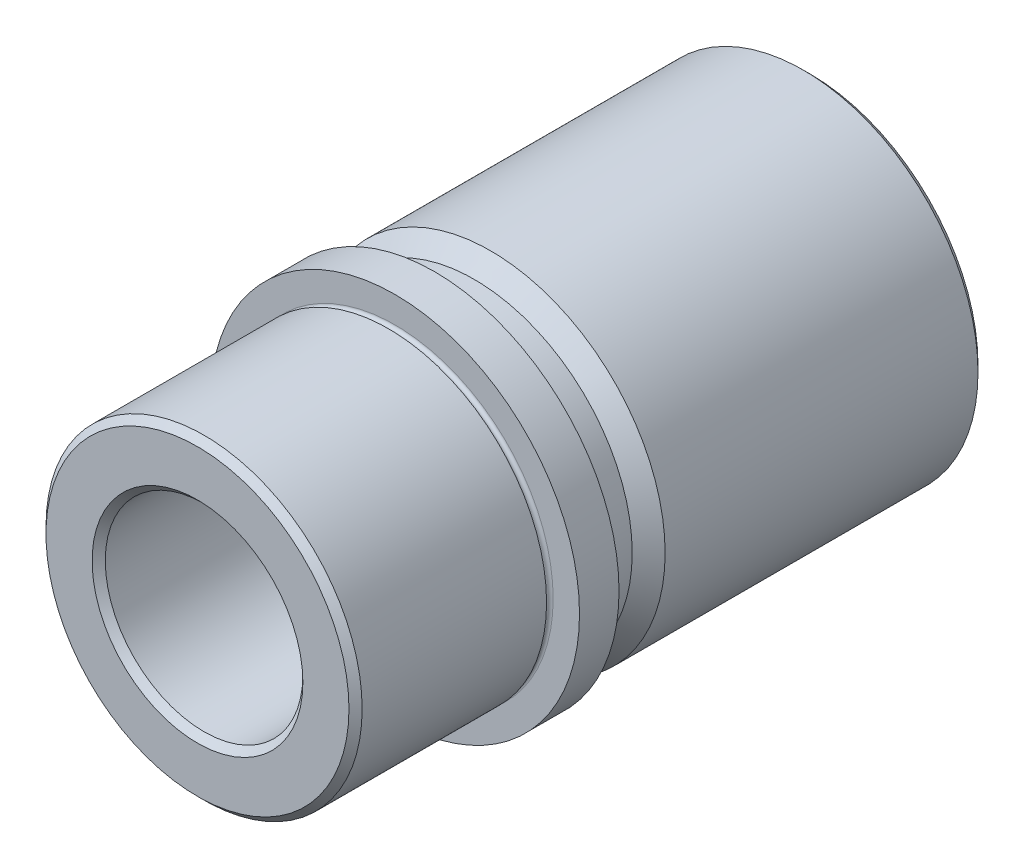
ISO-10303-21;
HEADER;
FILE_DESCRIPTION(('STEP AP214'),'2;1');
FILE_NAME('part.step','',(''),(''),'','','');
FILE_SCHEMA(('AUTOMOTIVE_DESIGN { 1 0 10303 214 1 1 1 1 }'));
ENDSEC;
DATA;
#1=APPLICATION_CONTEXT('core data for automotive mechanical design processes');
#2=APPLICATION_PROTOCOL_DEFINITION('international standard','automotive_design',2000,#1);
#3=PRODUCT_CONTEXT('',#1,'mechanical');
#4=PRODUCT('Part','Part','',(#3));
#5=PRODUCT_RELATED_PRODUCT_CATEGORY('part','',(#4));
#6=PRODUCT_DEFINITION_FORMATION('','',#4);
#7=PRODUCT_DEFINITION_CONTEXT('part definition',#1,'design');
#8=PRODUCT_DEFINITION('design','',#6,#7);
#9=PRODUCT_DEFINITION_SHAPE('','',#8);
#10=(LENGTH_UNIT() NAMED_UNIT(*) SI_UNIT(.MILLI.,.METRE.));
#11=(NAMED_UNIT(*) PLANE_ANGLE_UNIT() SI_UNIT($,.RADIAN.));
#12=(NAMED_UNIT(*) SI_UNIT($,.STERADIAN.) SOLID_ANGLE_UNIT());
#13=UNCERTAINTY_MEASURE_WITH_UNIT(LENGTH_MEASURE(1.E-05),#10,'distance_accuracy_value','');
#14=(GEOMETRIC_REPRESENTATION_CONTEXT(3) GLOBAL_UNCERTAINTY_ASSIGNED_CONTEXT((#13)) GLOBAL_UNIT_ASSIGNED_CONTEXT((#10,
#11,#12)) REPRESENTATION_CONTEXT('',''));
#15=CARTESIAN_POINT('',(0.,0.,0.));
#16=DIRECTION('',(0.,0.,1.));
#17=DIRECTION('',(1.,0.,0.));
#18=AXIS2_PLACEMENT_3D('',#15,#16,#17);
#19=CARTESIAN_POINT('',(0.,0.,-55.5));
#20=DIRECTION('',(0.,0.,1.));
#21=DIRECTION('',(1.,0.,0.));
#22=AXIS2_PLACEMENT_3D('',#19,#20,#21);
#23=TOROIDAL_SURFACE('',#22,15.5,0.5);
#24=CARTESIAN_POINT('',(0.,0.,-55.5));
#25=DIRECTION('',(0.,0.,1.));
#26=DIRECTION('',(1.,0.,0.));
#27=AXIS2_PLACEMENT_3D('',#24,#25,#26);
#28=CIRCLE('',#27,15.);
#29=CARTESIAN_POINT('',(15.,0.,-55.5));
#30=VERTEX_POINT('',#29);
#31=EDGE_CURVE('E82',#30,#30,#28,.T.);
#32=ORIENTED_EDGE('',*,*,#31,.T.);
#33=EDGE_LOOP('',(#32));
#34=FACE_BOUND('',#33,.T.);
#35=CARTESIAN_POINT('',(0.,0.,-56.));
#36=DIRECTION('',(0.,0.,1.));
#37=DIRECTION('',(1.,0.,0.));
#38=AXIS2_PLACEMENT_3D('',#35,#36,#37);
#39=CIRCLE('',#38,15.5);
#40=CARTESIAN_POINT('',(15.5,0.,-56.));
#41=VERTEX_POINT('',#40);
#42=EDGE_CURVE('E46',#41,#41,#39,.T.);
#43=ORIENTED_EDGE('',*,*,#42,.F.);
#44=EDGE_LOOP('',(#43));
#45=FACE_BOUND('',#44,.T.);
#46=ADVANCED_FACE('F14',(#34,#45),#23,.T.);
#47=CARTESIAN_POINT('',(0.,0.,-56.5));
#48=DIRECTION('',(0.,0.,1.));
#49=DIRECTION('',(1.,0.,0.));
#50=AXIS2_PLACEMENT_3D('',#47,#48,#49);
#51=TOROIDAL_SURFACE('',#50,15.5,0.5);
#52=CARTESIAN_POINT('',(0.,0.,-56.5));
#53=DIRECTION('',(0.,0.,1.));
#54=DIRECTION('',(1.,0.,0.));
#55=AXIS2_PLACEMENT_3D('',#52,#53,#54);
#56=CIRCLE('',#55,15.);
#57=CARTESIAN_POINT('',(15.,0.,-56.5));
#58=VERTEX_POINT('',#57);
#59=EDGE_CURVE('E49',#58,#58,#56,.T.);
#60=ORIENTED_EDGE('',*,*,#59,.F.);
#61=EDGE_LOOP('',(#60));
#62=FACE_BOUND('',#61,.T.);
#63=ORIENTED_EDGE('',*,*,#42,.T.);
#64=EDGE_LOOP('',(#63));
#65=FACE_BOUND('',#64,.T.);
#66=ADVANCED_FACE('F114',(#62,#65),#51,.T.);
#67=CARTESIAN_POINT('',(0.,0.,0.));
#68=DIRECTION('',(0.,0.,1.));
#69=DIRECTION('',(1.,0.,0.));
#70=AXIS2_PLACEMENT_3D('',#67,#68,#69);
#71=CYLINDRICAL_SURFACE('',#70,15.);
#72=CARTESIAN_POINT('',(0.,0.,-92.));
#73=DIRECTION('',(0.,0.,1.));
#74=DIRECTION('',(1.,0.,0.));
#75=AXIS2_PLACEMENT_3D('',#72,#73,#74);
#76=CIRCLE('',#75,15.);
#77=CARTESIAN_POINT('',(15.,0.,-92.));
#78=VERTEX_POINT('',#77);
#79=EDGE_CURVE('E37',#78,#78,#76,.F.);
#80=ORIENTED_EDGE('',*,*,#79,.T.);
#81=EDGE_LOOP('',(#80));
#82=FACE_BOUND('',#81,.T.);
#83=ORIENTED_EDGE('',*,*,#59,.T.);
#84=EDGE_LOOP('',(#83));
#85=FACE_BOUND('',#84,.T.);
#86=ADVANCED_FACE('F119',(#82,#85),#71,.F.);
#87=CARTESIAN_POINT('',(0.,0.,-93.));
#88=DIRECTION('',(0.,0.,1.));
#89=DIRECTION('',(1.,0.,0.));
#90=AXIS2_PLACEMENT_3D('',#87,#88,#89);
#91=PLANE('',#90);
#92=CARTESIAN_POINT('',(0.,0.,-93.));
#93=DIRECTION('',(0.,0.,1.));
#94=DIRECTION('',(1.,0.,0.));
#95=AXIS2_PLACEMENT_3D('',#92,#93,#94);
#96=CIRCLE('',#95,16.);
#97=CARTESIAN_POINT('',(16.,0.,-93.));
#98=VERTEX_POINT('',#97);
#99=EDGE_CURVE('E40',#98,#98,#96,.T.);
#100=ORIENTED_EDGE('',*,*,#99,.T.);
#101=EDGE_LOOP('',(#100));
#102=FACE_BOUND('',#101,.T.);
#103=CARTESIAN_POINT('',(0.,0.,-93.));
#104=DIRECTION('',(0.,0.,1.));
#105=DIRECTION('',(1.,0.,0.));
#106=AXIS2_PLACEMENT_3D('',#103,#104,#105);
#107=CIRCLE('',#106,25.5);
#108=CARTESIAN_POINT('',(25.5,0.,-93.));
#109=VERTEX_POINT('',#108);
#110=EDGE_CURVE('E43',#109,#109,#107,.F.);
#111=ORIENTED_EDGE('',*,*,#110,.T.);
#112=EDGE_LOOP('',(#111));
#113=FACE_BOUND('',#112,.T.);
#114=ADVANCED_FACE('F186',(#102,#113),#91,.F.);
#115=CARTESIAN_POINT('',(0.,0.,0.));
#116=DIRECTION('',(0.,0.,1.));
#117=DIRECTION('',(1.,0.,0.));
#118=AXIS2_PLACEMENT_3D('',#115,#116,#117);
#119=CYLINDRICAL_SURFACE('',#118,26.5);
#120=CARTESIAN_POINT('',(0.,0.,-92.));
#121=DIRECTION('',(0.,0.,1.));
#122=DIRECTION('',(1.,0.,0.));
#123=AXIS2_PLACEMENT_3D('',#120,#121,#122);
#124=CIRCLE('',#123,26.5);
#125=CARTESIAN_POINT('',(26.5,0.,-92.));
#126=VERTEX_POINT('',#125);
#127=EDGE_CURVE('E34',#126,#126,#124,.T.);
#128=ORIENTED_EDGE('',*,*,#127,.T.);
#129=EDGE_LOOP('',(#128));
#130=FACE_BOUND('',#129,.T.);
#131=CARTESIAN_POINT('',(0.,0.,-44.5));
#132=DIRECTION('',(0.,0.,1.));
#133=DIRECTION('',(1.,0.,0.));
#134=AXIS2_PLACEMENT_3D('',#131,#132,#133);
#135=CIRCLE('',#134,26.5);
#136=CARTESIAN_POINT('',(26.5,0.,-44.5));
#137=VERTEX_POINT('',#136);
#138=EDGE_CURVE('E52',#137,#137,#135,.T.);
#139=ORIENTED_EDGE('',*,*,#138,.F.);
#140=EDGE_LOOP('',(#139));
#141=FACE_BOUND('',#140,.T.);
#142=ADVANCED_FACE('F182',(#130,#141),#119,.T.);
#143=CARTESIAN_POINT('',(0.,0.,-42.));
#144=DIRECTION('',(0.,0.,-1.));
#145=DIRECTION('',(-1.,0.,0.));
#146=AXIS2_PLACEMENT_3D('',#143,#144,#145);
#147=CONICAL_SURFACE('',#146,24.,0.78539816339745);
#148=ORIENTED_EDGE('',*,*,#138,.T.);
#149=EDGE_LOOP('',(#148));
#150=FACE_BOUND('',#149,.T.);
#151=CARTESIAN_POINT('',(0.,0.,-42.));
#152=DIRECTION('',(0.,0.,1.));
#153=DIRECTION('',(1.,0.,0.));
#154=AXIS2_PLACEMENT_3D('',#151,#152,#153);
#155=CIRCLE('',#154,24.);
#156=CARTESIAN_POINT('',(24.,0.,-42.));
#157=VERTEX_POINT('',#156);
#158=EDGE_CURVE('E55',#157,#157,#155,.T.);
#159=ORIENTED_EDGE('',*,*,#158,.F.);
#160=EDGE_LOOP('',(#159));
#161=FACE_BOUND('',#160,.T.);
#162=ADVANCED_FACE('F178',(#150,#161),#147,.T.);
#163=CARTESIAN_POINT('',(0.,0.,0.));
#164=DIRECTION('',(0.,0.,1.));
#165=DIRECTION('',(1.,0.,0.));
#166=AXIS2_PLACEMENT_3D('',#163,#164,#165);
#167=CYLINDRICAL_SURFACE('',#166,24.);
#168=ORIENTED_EDGE('',*,*,#158,.T.);
#169=EDGE_LOOP('',(#168));
#170=FACE_BOUND('',#169,.T.);
#171=CARTESIAN_POINT('',(0.,0.,-36.));
#172=DIRECTION('',(0.,0.,1.));
#173=DIRECTION('',(1.,0.,0.));
#174=AXIS2_PLACEMENT_3D('',#171,#172,#173);
#175=CIRCLE('',#174,24.);
#176=CARTESIAN_POINT('',(24.,0.,-36.));
#177=VERTEX_POINT('',#176);
#178=EDGE_CURVE('E58',#177,#177,#175,.T.);
#179=ORIENTED_EDGE('',*,*,#178,.F.);
#180=EDGE_LOOP('',(#179));
#181=FACE_BOUND('',#180,.T.);
#182=ADVANCED_FACE('F174',(#170,#181),#167,.T.);
#183=CARTESIAN_POINT('',(0.,0.,-36.));
#184=DIRECTION('',(0.,0.,-1.));
#185=DIRECTION('',(-1.,0.,0.));
#186=AXIS2_PLACEMENT_3D('',#183,#184,#185);
#187=PLANE('',#186);
#188=ORIENTED_EDGE('',*,*,#178,.T.);
#189=EDGE_LOOP('',(#188));
#190=FACE_BOUND('',#189,.T.);
#191=CARTESIAN_POINT('',(0.,0.,-36.));
#192=DIRECTION('',(0.,0.,1.));
#193=DIRECTION('',(1.,0.,0.));
#194=AXIS2_PLACEMENT_3D('',#191,#192,#193);
#195=CIRCLE('',#194,28.);
#196=CARTESIAN_POINT('',(28.,0.,-36.));
#197=VERTEX_POINT('',#196);
#198=EDGE_CURVE('E61',#197,#197,#195,.T.);
#199=ORIENTED_EDGE('',*,*,#198,.F.);
#200=EDGE_LOOP('',(#199));
#201=FACE_BOUND('',#200,.T.);
#202=ADVANCED_FACE('F170',(#190,#201),#187,.T.);
#203=CARTESIAN_POINT('',(0.,0.,0.));
#204=DIRECTION('',(0.,0.,1.));
#205=DIRECTION('',(1.,0.,0.));
#206=AXIS2_PLACEMENT_3D('',#203,#204,#205);
#207=CYLINDRICAL_SURFACE('',#206,28.);
#208=ORIENTED_EDGE('',*,*,#198,.T.);
#209=EDGE_LOOP('',(#208));
#210=FACE_BOUND('',#209,.T.);
#211=CARTESIAN_POINT('',(0.,0.,-30.));
#212=DIRECTION('',(0.,0.,1.));
#213=DIRECTION('',(1.,0.,0.));
#214=AXIS2_PLACEMENT_3D('',#211,#212,#213);
#215=CIRCLE('',#214,28.);
#216=CARTESIAN_POINT('',(28.,0.,-30.));
#217=VERTEX_POINT('',#216);
#218=EDGE_CURVE('E64',#217,#217,#215,.T.);
#219=ORIENTED_EDGE('',*,*,#218,.F.);
#220=EDGE_LOOP('',(#219));
#221=FACE_BOUND('',#220,.T.);
#222=ADVANCED_FACE('F166',(#210,#221),#207,.T.);
#223=CARTESIAN_POINT('',(0.,0.,-30.));
#224=DIRECTION('',(0.,0.,1.));
#225=DIRECTION('',(1.,0.,0.));
#226=AXIS2_PLACEMENT_3D('',#223,#224,#225);
#227=PLANE('',#226);
#228=ORIENTED_EDGE('',*,*,#218,.T.);
#229=EDGE_LOOP('',(#228));
#230=FACE_BOUND('',#229,.T.);
#231=CARTESIAN_POINT('',(0.,0.,-30.));
#232=DIRECTION('',(0.,0.,1.));
#233=DIRECTION('',(1.,0.,0.));
#234=AXIS2_PLACEMENT_3D('',#231,#232,#233);
#235=CIRCLE('',#234,24.);
#236=CARTESIAN_POINT('',(24.,0.,-30.));
#237=VERTEX_POINT('',#236);
#238=EDGE_CURVE('E67',#237,#237,#235,.T.);
#239=ORIENTED_EDGE('',*,*,#238,.F.);
#240=EDGE_LOOP('',(#239));
#241=FACE_BOUND('',#240,.T.);
#242=ADVANCED_FACE('F162',(#230,#241),#227,.T.);
#243=CARTESIAN_POINT('',(0.,0.,-29.5));
#244=DIRECTION('',(0.,0.,1.));
#245=DIRECTION('',(1.,0.,0.));
#246=AXIS2_PLACEMENT_3D('',#243,#244,#245);
#247=TOROIDAL_SURFACE('',#246,24.,0.5);
#248=ORIENTED_EDGE('',*,*,#238,.T.);
#249=EDGE_LOOP('',(#248));
#250=FACE_BOUND('',#249,.T.);
#251=CARTESIAN_POINT('',(0.,0.,-29.));
#252=DIRECTION('',(0.,0.,1.));
#253=DIRECTION('',(1.,0.,0.));
#254=AXIS2_PLACEMENT_3D('',#251,#252,#253);
#255=CIRCLE('',#254,24.);
#256=CARTESIAN_POINT('',(24.,0.,-29.));
#257=VERTEX_POINT('',#256);
#258=EDGE_CURVE('E70',#257,#257,#255,.T.);
#259=ORIENTED_EDGE('',*,*,#258,.F.);
#260=EDGE_LOOP('',(#259));
#261=FACE_BOUND('',#260,.T.);
#262=ADVANCED_FACE('F157',(#250,#261),#247,.F.);
#263=CARTESIAN_POINT('',(0.,0.,0.));
#264=DIRECTION('',(0.,0.,1.));
#265=DIRECTION('',(1.,0.,0.));
#266=AXIS2_PLACEMENT_3D('',#263,#264,#265);
#267=CYLINDRICAL_SURFACE('',#266,24.);
#268=CARTESIAN_POINT('',(0.,0.,-1.00000000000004));
#269=DIRECTION('',(0.,0.,1.));
#270=DIRECTION('',(1.,0.,0.));
#271=AXIS2_PLACEMENT_3D('',#268,#269,#270);
#272=CIRCLE('',#271,24.);
#273=CARTESIAN_POINT('',(24.,0.,-1.00000000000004));
#274=VERTEX_POINT('',#273);
#275=EDGE_CURVE('E9',#274,#274,#272,.F.);
#276=ORIENTED_EDGE('',*,*,#275,.T.);
#277=EDGE_LOOP('',(#276));
#278=FACE_BOUND('',#277,.T.);
#279=ORIENTED_EDGE('',*,*,#258,.T.);
#280=EDGE_LOOP('',(#279));
#281=FACE_BOUND('',#280,.T.);
#282=ADVANCED_FACE('F150',(#278,#281),#267,.T.);
#283=CARTESIAN_POINT('',(0.,0.,0.));
#284=DIRECTION('',(0.,0.,1.));
#285=DIRECTION('',(1.,0.,0.));
#286=AXIS2_PLACEMENT_3D('',#283,#284,#285);
#287=PLANE('',#286);
#288=CARTESIAN_POINT('',(0.,0.,0.));
#289=DIRECTION('',(0.,0.,1.));
#290=DIRECTION('',(1.,0.,0.));
#291=AXIS2_PLACEMENT_3D('',#288,#289,#290);
#292=CIRCLE('',#291,16.);
#293=CARTESIAN_POINT('',(16.,0.,0.));
#294=VERTEX_POINT('',#293);
#295=EDGE_CURVE('E21',#294,#294,#292,.F.);
#296=ORIENTED_EDGE('',*,*,#295,.T.);
#297=EDGE_LOOP('',(#296));
#298=FACE_BOUND('',#297,.T.);
#299=CARTESIAN_POINT('',(0.,0.,0.));
#300=DIRECTION('',(0.,0.,1.));
#301=DIRECTION('',(1.,0.,0.));
#302=AXIS2_PLACEMENT_3D('',#299,#300,#301);
#303=CIRCLE('',#302,23.);
#304=CARTESIAN_POINT('',(23.,0.,0.));
#305=VERTEX_POINT('',#304);
#306=EDGE_CURVE('E25',#305,#305,#303,.T.);
#307=ORIENTED_EDGE('',*,*,#306,.T.);
#308=EDGE_LOOP('',(#307));
#309=FACE_BOUND('',#308,.T.);
#310=ADVANCED_FACE('F110',(#298,#309),#287,.T.);
#311=CARTESIAN_POINT('',(0.,0.,0.));
#312=DIRECTION('',(0.,0.,1.));
#313=DIRECTION('',(1.,0.,0.));
#314=AXIS2_PLACEMENT_3D('',#311,#312,#313);
#315=CYLINDRICAL_SURFACE('',#314,15.);
#316=CARTESIAN_POINT('',(0.,0.,-0.999999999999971));
#317=DIRECTION('',(0.,0.,1.));
#318=DIRECTION('',(1.,0.,0.));
#319=AXIS2_PLACEMENT_3D('',#316,#317,#318);
#320=CIRCLE('',#319,15.);
#321=CARTESIAN_POINT('',(15.,0.,-0.999999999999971));
#322=VERTEX_POINT('',#321);
#323=EDGE_CURVE('E29',#322,#322,#320,.T.);
#324=ORIENTED_EDGE('',*,*,#323,.T.);
#325=EDGE_LOOP('',(#324));
#326=FACE_BOUND('',#325,.T.);
#327=CARTESIAN_POINT('',(0.,0.,-22.5));
#328=DIRECTION('',(0.,0.,1.));
#329=DIRECTION('',(1.,0.,0.));
#330=AXIS2_PLACEMENT_3D('',#327,#328,#329);
#331=CIRCLE('',#330,15.);
#332=CARTESIAN_POINT('',(15.,0.,-22.5));
#333=VERTEX_POINT('',#332);
#334=EDGE_CURVE('E73',#333,#333,#331,.T.);
#335=ORIENTED_EDGE('',*,*,#334,.F.);
#336=EDGE_LOOP('',(#335));
#337=FACE_BOUND('',#336,.T.);
#338=ADVANCED_FACE('F103',(#326,#337),#315,.F.);
#339=CARTESIAN_POINT('',(0.,0.,-22.5));
#340=DIRECTION('',(0.,0.,1.));
#341=DIRECTION('',(1.,0.,0.));
#342=AXIS2_PLACEMENT_3D('',#339,#340,#341);
#343=TOROIDAL_SURFACE('',#342,15.5,0.5);
#344=ORIENTED_EDGE('',*,*,#334,.T.);
#345=EDGE_LOOP('',(#344));
#346=FACE_BOUND('',#345,.T.);
#347=CARTESIAN_POINT('',(0.,0.,-23.));
#348=DIRECTION('',(0.,0.,1.));
#349=DIRECTION('',(1.,0.,0.));
#350=AXIS2_PLACEMENT_3D('',#347,#348,#349);
#351=CIRCLE('',#350,15.5);
#352=CARTESIAN_POINT('',(15.5,0.,-23.));
#353=VERTEX_POINT('',#352);
#354=EDGE_CURVE('E76',#353,#353,#351,.T.);
#355=ORIENTED_EDGE('',*,*,#354,.F.);
#356=EDGE_LOOP('',(#355));
#357=FACE_BOUND('',#356,.T.);
#358=ADVANCED_FACE('F98',(#346,#357),#343,.T.);
#359=CARTESIAN_POINT('',(0.,0.,-23.5));
#360=DIRECTION('',(0.,0.,1.));
#361=DIRECTION('',(1.,0.,0.));
#362=AXIS2_PLACEMENT_3D('',#359,#360,#361);
#363=TOROIDAL_SURFACE('',#362,15.5,0.5);
#364=CARTESIAN_POINT('',(0.,0.,-23.5));
#365=DIRECTION('',(0.,0.,1.));
#366=DIRECTION('',(1.,0.,0.));
#367=AXIS2_PLACEMENT_3D('',#364,#365,#366);
#368=CIRCLE('',#367,15.);
#369=CARTESIAN_POINT('',(15.,0.,-23.5));
#370=VERTEX_POINT('',#369);
#371=EDGE_CURVE('E79',#370,#370,#368,.T.);
#372=ORIENTED_EDGE('',*,*,#371,.F.);
#373=EDGE_LOOP('',(#372));
#374=FACE_BOUND('',#373,.T.);
#375=ORIENTED_EDGE('',*,*,#354,.T.);
#376=EDGE_LOOP('',(#375));
#377=FACE_BOUND('',#376,.T.);
#378=ADVANCED_FACE('F92',(#374,#377),#363,.T.);
#379=CARTESIAN_POINT('',(0.,0.,0.));
#380=DIRECTION('',(0.,0.,1.));
#381=DIRECTION('',(1.,0.,0.));
#382=AXIS2_PLACEMENT_3D('',#379,#380,#381);
#383=CYLINDRICAL_SURFACE('',#382,15.);
#384=ORIENTED_EDGE('',*,*,#31,.F.);
#385=EDGE_LOOP('',(#384));
#386=FACE_BOUND('',#385,.T.);
#387=ORIENTED_EDGE('',*,*,#371,.T.);
#388=EDGE_LOOP('',(#387));
#389=FACE_BOUND('',#388,.T.);
#390=ADVANCED_FACE('F88',(#386,#389),#383,.F.);
#391=CARTESIAN_POINT('',(0.,0.,-93.));
#392=DIRECTION('',(0.,0.,-1.));
#393=DIRECTION('',(-1.,0.,0.));
#394=AXIS2_PLACEMENT_3D('',#391,#392,#393);
#395=CONICAL_SURFACE('',#394,16.,0.785398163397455);
#396=ORIENTED_EDGE('',*,*,#79,.F.);
#397=EDGE_LOOP('',(#396));
#398=FACE_BOUND('',#397,.T.);
#399=ORIENTED_EDGE('',*,*,#99,.F.);
#400=EDGE_LOOP('',(#399));
#401=FACE_BOUND('',#400,.T.);
#402=ADVANCED_FACE('F91',(#398,#401),#395,.F.);
#403=CARTESIAN_POINT('',(0.,0.,-92.));
#404=DIRECTION('',(0.,0.,1.));
#405=DIRECTION('',(1.,0.,0.));
#406=AXIS2_PLACEMENT_3D('',#403,#404,#405);
#407=CONICAL_SURFACE('',#406,26.5,0.785398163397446);
#408=ORIENTED_EDGE('',*,*,#110,.F.);
#409=EDGE_LOOP('',(#408));
#410=FACE_BOUND('',#409,.T.);
#411=ORIENTED_EDGE('',*,*,#127,.F.);
#412=EDGE_LOOP('',(#411));
#413=FACE_BOUND('',#412,.T.);
#414=ADVANCED_FACE('F126',(#410,#413),#407,.T.);
#415=CARTESIAN_POINT('',(0.,0.,-0.999999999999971));
#416=DIRECTION('',(0.,0.,1.));
#417=DIRECTION('',(1.,0.,0.));
#418=AXIS2_PLACEMENT_3D('',#415,#416,#417);
#419=CONICAL_SURFACE('',#418,15.,0.785398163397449);
#420=ORIENTED_EDGE('',*,*,#295,.F.);
#421=EDGE_LOOP('',(#420));
#422=FACE_BOUND('',#421,.T.);
#423=ORIENTED_EDGE('',*,*,#323,.F.);
#424=EDGE_LOOP('',(#423));
#425=FACE_BOUND('',#424,.T.);
#426=ADVANCED_FACE('F129',(#422,#425),#419,.F.);
#427=CARTESIAN_POINT('',(0.,0.,0.));
#428=DIRECTION('',(0.,0.,-1.));
#429=DIRECTION('',(-1.,0.,0.));
#430=AXIS2_PLACEMENT_3D('',#427,#428,#429);
#431=CONICAL_SURFACE('',#430,23.,0.785398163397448);
#432=ORIENTED_EDGE('',*,*,#275,.F.);
#433=EDGE_LOOP('',(#432));
#434=FACE_BOUND('',#433,.T.);
#435=ORIENTED_EDGE('',*,*,#306,.F.);
#436=EDGE_LOOP('',(#435));
#437=FACE_BOUND('',#436,.T.);
#438=ADVANCED_FACE('F16',(#434,#437),#431,.T.);
#439=CLOSED_SHELL('',(#46,#66,#86,#114,#142,#162,#182,#202,#222,#242,#262,#282,#310,#338,#358,
#378,#390,#402,#414,#426,#438));
#440=MANIFOLD_SOLID_BREP('B1',#439);
#441=ADVANCED_BREP_SHAPE_REPRESENTATION('',(#18,#440),#14);
#442=SHAPE_DEFINITION_REPRESENTATION(#9,#441);
ENDSEC;
END-ISO-10303-21;
